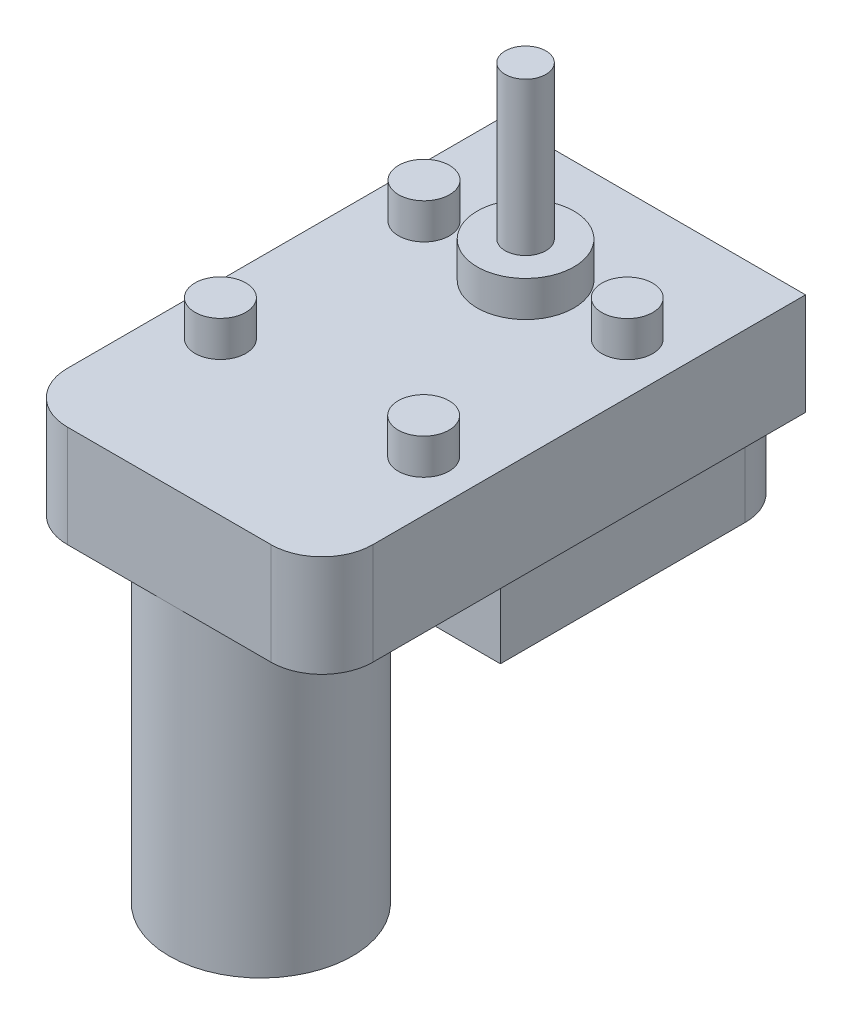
ISO-10303-21;
HEADER;
FILE_DESCRIPTION(('STEP AP214'),'2;1');
FILE_NAME('part.step','',(''),(''),'','','');
FILE_SCHEMA(('AUTOMOTIVE_DESIGN { 1 0 10303 214 1 1 1 1 }'));
ENDSEC;
DATA;
#1=APPLICATION_CONTEXT('core data for automotive mechanical design processes');
#2=APPLICATION_PROTOCOL_DEFINITION('international standard','automotive_design',2000,#1);
#3=PRODUCT_CONTEXT('',#1,'mechanical');
#4=PRODUCT('Part','Part','',(#3));
#5=PRODUCT_RELATED_PRODUCT_CATEGORY('part','',(#4));
#6=PRODUCT_DEFINITION_FORMATION('','',#4);
#7=PRODUCT_DEFINITION_CONTEXT('part definition',#1,'design');
#8=PRODUCT_DEFINITION('design','',#6,#7);
#9=PRODUCT_DEFINITION_SHAPE('','',#8);
#10=(LENGTH_UNIT() NAMED_UNIT(*) SI_UNIT(.MILLI.,.METRE.));
#11=(NAMED_UNIT(*) PLANE_ANGLE_UNIT() SI_UNIT($,.RADIAN.));
#12=(NAMED_UNIT(*) SI_UNIT($,.STERADIAN.) SOLID_ANGLE_UNIT());
#13=UNCERTAINTY_MEASURE_WITH_UNIT(LENGTH_MEASURE(1.E-05),#10,'distance_accuracy_value','');
#14=(GEOMETRIC_REPRESENTATION_CONTEXT(3) GLOBAL_UNCERTAINTY_ASSIGNED_CONTEXT((#13)) GLOBAL_UNIT_ASSIGNED_CONTEXT((#10,
#11,#12)) REPRESENTATION_CONTEXT('',''));
#15=CARTESIAN_POINT('',(0.,0.,0.));
#16=DIRECTION('',(0.,0.,1.));
#17=DIRECTION('',(1.,0.,0.));
#18=AXIS2_PLACEMENT_3D('',#15,#16,#17);
#19=CARTESIAN_POINT('',(0.,0.,0.));
#20=DIRECTION('',(0.,1.,0.));
#21=DIRECTION('',(0.,0.,1.));
#22=AXIS2_PLACEMENT_3D('',#19,#20,#21);
#23=PLANE('',#22);
#24=DIRECTION('',(0.,0.,-1.));
#25=VECTOR('',#24,1.);
#26=CARTESIAN_POINT('',(34.1666666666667,0.,-14.1287878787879));
#27=LINE('',#26,#25);
#28=CARTESIAN_POINT('',(34.1666666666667,0.,70.8712121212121));
#29=VERTEX_POINT('',#28);
#30=CARTESIAN_POINT('',(34.1666666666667,0.,-14.1287878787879));
#31=VERTEX_POINT('',#30);
#32=EDGE_CURVE('E226',#29,#31,#27,.T.);
#33=ORIENTED_EDGE('',*,*,#32,.F.);
#34=CARTESIAN_POINT('',(24.1666666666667,0.,70.8712121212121));
#35=DIRECTION('',(0.,1.,0.));
#36=DIRECTION('',(0.,0.,1.));
#37=AXIS2_PLACEMENT_3D('',#34,#35,#36);
#38=CIRCLE('',#37,10.);
#39=CARTESIAN_POINT('',(24.1666666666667,0.,80.8712121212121));
#40=VERTEX_POINT('',#39);
#41=EDGE_CURVE('E253',#29,#40,#38,.F.);
#42=ORIENTED_EDGE('',*,*,#41,.T.);
#43=DIRECTION('',(1.,0.,0.));
#44=VECTOR('',#43,1.);
#45=CARTESIAN_POINT('',(-25.8333333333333,0.,80.8712121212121));
#46=LINE('',#45,#44);
#47=CARTESIAN_POINT('',(4.16666666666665,0.,80.8712121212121));
#48=VERTEX_POINT('',#47);
#49=EDGE_CURVE('E223',#48,#40,#46,.T.);
#50=ORIENTED_EDGE('',*,*,#49,.F.);
#51=CARTESIAN_POINT('',(4.16666666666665,0.,62.8712121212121));
#52=DIRECTION('',(0.,-1.,0.));
#53=DIRECTION('',(0.,0.,-1.));
#54=AXIS2_PLACEMENT_3D('',#51,#52,#53);
#55=CIRCLE('',#54,18.);
#56=EDGE_CURVE('E148',#48,#48,#55,.T.);
#57=ORIENTED_EDGE('',*,*,#56,.F.);
#58=CARTESIAN_POINT('',(-15.8333333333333,0.,80.8712121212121));
#59=VERTEX_POINT('',#58);
#60=EDGE_CURVE('E224',#59,#48,#46,.T.);
#61=ORIENTED_EDGE('',*,*,#60,.F.);
#62=CARTESIAN_POINT('',(-15.8333333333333,0.,70.8712121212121));
#63=DIRECTION('',(0.,1.,0.));
#64=DIRECTION('',(0.,0.,1.));
#65=AXIS2_PLACEMENT_3D('',#62,#63,#64);
#66=CIRCLE('',#65,10.);
#67=CARTESIAN_POINT('',(-25.8333333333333,0.,70.8712121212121));
#68=VERTEX_POINT('',#67);
#69=EDGE_CURVE('E251',#59,#68,#66,.F.);
#70=ORIENTED_EDGE('',*,*,#69,.T.);
#71=DIRECTION('',(0.,0.,1.));
#72=VECTOR('',#71,1.);
#73=CARTESIAN_POINT('',(-25.8333333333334,0.,-14.1287878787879));
#74=LINE('',#73,#72);
#75=CARTESIAN_POINT('',(-25.8333333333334,0.,-14.1287878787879));
#76=VERTEX_POINT('',#75);
#77=EDGE_CURVE('E209',#76,#68,#74,.T.);
#78=ORIENTED_EDGE('',*,*,#77,.F.);
#79=DIRECTION('',(-1.,0.,0.));
#80=VECTOR('',#79,1.);
#81=CARTESIAN_POINT('',(-25.8333333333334,0.,-14.1287878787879));
#82=LINE('',#81,#80);
#83=EDGE_CURVE('E215',#31,#76,#82,.T.);
#84=ORIENTED_EDGE('',*,*,#83,.F.);
#85=EDGE_LOOP('',(#33,#42,#50,#57,#61,#70,#78,#84));
#86=FACE_BOUND('',#85,.T.);
#87=DIRECTION('',(0.,0.,-1.));
#88=VECTOR('',#87,1.);
#89=CARTESIAN_POINT('',(-23.9045827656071,0.,44.6180599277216));
#90=LINE('',#89,#88);
#91=CARTESIAN_POINT('',(-23.9045827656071,0.,44.6180599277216));
#92=VERTEX_POINT('',#91);
#93=CARTESIAN_POINT('',(-23.9045827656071,0.,-3.43556887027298));
#94=VERTEX_POINT('',#93);
#95=EDGE_CURVE('E158',#92,#94,#90,.T.);
#96=ORIENTED_EDGE('',*,*,#95,.F.);
#97=DIRECTION('',(-1.,0.,0.));
#98=VECTOR('',#97,1.);
#99=CARTESIAN_POINT('',(-23.9045827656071,0.,44.6180599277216));
#100=LINE('',#99,#98);
#101=CARTESIAN_POINT('',(32.9702921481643,0.,44.6180599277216));
#102=VERTEX_POINT('',#101);
#103=EDGE_CURVE('E165',#102,#92,#100,.T.);
#104=ORIENTED_EDGE('',*,*,#103,.F.);
#105=DIRECTION('',(0.,0.,1.));
#106=VECTOR('',#105,1.);
#107=CARTESIAN_POINT('',(32.9702921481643,0.,44.6180599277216));
#108=LINE('',#107,#106);
#109=CARTESIAN_POINT('',(32.9702921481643,0.,-3.43556887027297));
#110=VERTEX_POINT('',#109);
#111=EDGE_CURVE('E144',#110,#102,#108,.T.);
#112=ORIENTED_EDGE('',*,*,#111,.F.);
#113=CARTESIAN_POINT('',(22.9702921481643,0.,-3.43556887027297));
#114=DIRECTION('',(0.,1.,0.));
#115=DIRECTION('',(0.,0.,1.));
#116=AXIS2_PLACEMENT_3D('',#113,#114,#115);
#117=CIRCLE('',#116,10.);
#118=CARTESIAN_POINT('',(22.9702921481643,0.,-13.435568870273));
#119=VERTEX_POINT('',#118);
#120=EDGE_CURVE('E244',#110,#119,#117,.T.);
#121=ORIENTED_EDGE('',*,*,#120,.T.);
#122=DIRECTION('',(1.,0.,0.));
#123=VECTOR('',#122,1.);
#124=CARTESIAN_POINT('',(-23.9045827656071,0.,-13.435568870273));
#125=LINE('',#124,#123);
#126=CARTESIAN_POINT('',(-13.9045827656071,0.,-13.435568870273));
#127=VERTEX_POINT('',#126);
#128=EDGE_CURVE('E161',#127,#119,#125,.T.);
#129=ORIENTED_EDGE('',*,*,#128,.F.);
#130=CARTESIAN_POINT('',(-13.9045827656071,0.,-3.43556887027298));
#131=DIRECTION('',(0.,1.,0.));
#132=DIRECTION('',(0.,0.,1.));
#133=AXIS2_PLACEMENT_3D('',#130,#131,#132);
#134=CIRCLE('',#133,10.);
#135=EDGE_CURVE('E246',#127,#94,#134,.T.);
#136=ORIENTED_EDGE('',*,*,#135,.T.);
#137=EDGE_LOOP('',(#96,#104,#112,#121,#129,#136));
#138=FACE_BOUND('',#137,.T.);
#139=ADVANCED_FACE('F32',(#86,#138),#23,.F.);
#140=CARTESIAN_POINT('',(-25.8333333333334,20.,-14.1287878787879));
#141=DIRECTION('',(1.,0.,0.));
#142=DIRECTION('',(0.,0.,-1.));
#143=AXIS2_PLACEMENT_3D('',#140,#141,#142);
#144=PLANE('',#143);
#145=ORIENTED_EDGE('',*,*,#77,.T.);
#146=DIRECTION('',(0.,-1.,0.));
#147=VECTOR('',#146,1.);
#148=CARTESIAN_POINT('',(-25.8333333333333,20.,70.8712121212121));
#149=LINE('',#148,#147);
#150=CARTESIAN_POINT('',(-25.8333333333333,20.,70.8712121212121));
#151=VERTEX_POINT('',#150);
#152=EDGE_CURVE('E11',#68,#151,#149,.F.);
#153=ORIENTED_EDGE('',*,*,#152,.T.);
#154=DIRECTION('',(0.,0.,1.));
#155=VECTOR('',#154,1.);
#156=CARTESIAN_POINT('',(-25.8333333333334,20.,-14.1287878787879));
#157=LINE('',#156,#155);
#158=CARTESIAN_POINT('',(-25.8333333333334,20.,-14.1287878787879));
#159=VERTEX_POINT('',#158);
#160=EDGE_CURVE('E212',#159,#151,#157,.T.);
#161=ORIENTED_EDGE('',*,*,#160,.F.);
#162=DIRECTION('',(0.,-1.,0.));
#163=VECTOR('',#162,1.);
#164=CARTESIAN_POINT('',(-25.8333333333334,20.,-14.1287878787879));
#165=LINE('',#164,#163);
#166=EDGE_CURVE('E221',#159,#76,#165,.T.);
#167=ORIENTED_EDGE('',*,*,#166,.T.);
#168=EDGE_LOOP('',(#145,#153,#161,#167));
#169=FACE_BOUND('',#168,.T.);
#170=ADVANCED_FACE('F300',(#169),#144,.F.);
#171=CARTESIAN_POINT('',(-25.8333333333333,20.,80.8712121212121));
#172=DIRECTION('',(0.,0.,-1.));
#173=DIRECTION('',(-1.,0.,0.));
#174=AXIS2_PLACEMENT_3D('',#171,#172,#173);
#175=PLANE('',#174);
#176=ORIENTED_EDGE('',*,*,#49,.T.);
#177=DIRECTION('',(0.,-1.,0.));
#178=VECTOR('',#177,1.);
#179=CARTESIAN_POINT('',(24.1666666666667,20.,80.8712121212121));
#180=LINE('',#179,#178);
#181=CARTESIAN_POINT('',(24.1666666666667,20.,80.8712121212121));
#182=VERTEX_POINT('',#181);
#183=EDGE_CURVE('E53',#40,#182,#180,.F.);
#184=ORIENTED_EDGE('',*,*,#183,.T.);
#185=DIRECTION('',(1.,0.,0.));
#186=VECTOR('',#185,1.);
#187=CARTESIAN_POINT('',(-25.8333333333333,20.,80.8712121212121));
#188=LINE('',#187,#186);
#189=CARTESIAN_POINT('',(-15.8333333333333,20.,80.8712121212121));
#190=VERTEX_POINT('',#189);
#191=EDGE_CURVE('E214',#190,#182,#188,.T.);
#192=ORIENTED_EDGE('',*,*,#191,.F.);
#193=DIRECTION('',(0.,-1.,0.));
#194=VECTOR('',#193,1.);
#195=CARTESIAN_POINT('',(-15.8333333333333,20.,80.8712121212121));
#196=LINE('',#195,#194);
#197=EDGE_CURVE('E255',#190,#59,#196,.T.);
#198=ORIENTED_EDGE('',*,*,#197,.T.);
#199=ORIENTED_EDGE('',*,*,#60,.T.);
#200=EDGE_LOOP('',(#176,#184,#192,#198,#199));
#201=FACE_BOUND('',#200,.T.);
#202=ADVANCED_FACE('F277',(#201),#175,.F.);
#203=CARTESIAN_POINT('',(34.1666666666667,20.,-14.1287878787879));
#204=DIRECTION('',(-1.,0.,0.));
#205=DIRECTION('',(0.,0.,1.));
#206=AXIS2_PLACEMENT_3D('',#203,#204,#205);
#207=PLANE('',#206);
#208=DIRECTION('',(0.,0.,-1.));
#209=VECTOR('',#208,1.);
#210=CARTESIAN_POINT('',(34.1666666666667,20.,-14.1287878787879));
#211=LINE('',#210,#209);
#212=CARTESIAN_POINT('',(34.1666666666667,20.,70.8712121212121));
#213=VERTEX_POINT('',#212);
#214=CARTESIAN_POINT('',(34.1666666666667,20.,-14.1287878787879));
#215=VERTEX_POINT('',#214);
#216=EDGE_CURVE('E217',#213,#215,#211,.T.);
#217=ORIENTED_EDGE('',*,*,#216,.F.);
#218=DIRECTION('',(0.,-1.,0.));
#219=VECTOR('',#218,1.);
#220=CARTESIAN_POINT('',(34.1666666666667,20.,70.8712121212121));
#221=LINE('',#220,#219);
#222=EDGE_CURVE('E248',#213,#29,#221,.T.);
#223=ORIENTED_EDGE('',*,*,#222,.T.);
#224=ORIENTED_EDGE('',*,*,#32,.T.);
#225=DIRECTION('',(0.,-1.,0.));
#226=VECTOR('',#225,1.);
#227=CARTESIAN_POINT('',(34.1666666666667,20.,-14.1287878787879));
#228=LINE('',#227,#226);
#229=EDGE_CURVE('E181',#215,#31,#228,.T.);
#230=ORIENTED_EDGE('',*,*,#229,.F.);
#231=EDGE_LOOP('',(#217,#223,#224,#230));
#232=FACE_BOUND('',#231,.T.);
#233=ADVANCED_FACE('F268',(#232),#207,.F.);
#234=CARTESIAN_POINT('',(-25.8333333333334,20.,-14.1287878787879));
#235=DIRECTION('',(0.,0.,1.));
#236=DIRECTION('',(1.,0.,0.));
#237=AXIS2_PLACEMENT_3D('',#234,#235,#236);
#238=PLANE('',#237);
#239=ORIENTED_EDGE('',*,*,#83,.T.);
#240=ORIENTED_EDGE('',*,*,#166,.F.);
#241=DIRECTION('',(-1.,0.,0.));
#242=VECTOR('',#241,1.);
#243=CARTESIAN_POINT('',(-25.8333333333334,20.,-14.1287878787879));
#244=LINE('',#243,#242);
#245=EDGE_CURVE('E219',#215,#159,#244,.T.);
#246=ORIENTED_EDGE('',*,*,#245,.F.);
#247=ORIENTED_EDGE('',*,*,#229,.T.);
#248=EDGE_LOOP('',(#239,#240,#246,#247));
#249=FACE_BOUND('',#248,.T.);
#250=ADVANCED_FACE('F309',(#249),#238,.F.);
#251=CARTESIAN_POINT('',(0.,20.,0.));
#252=DIRECTION('',(0.,1.,0.));
#253=DIRECTION('',(0.,0.,1.));
#254=AXIS2_PLACEMENT_3D('',#251,#252,#253);
#255=PLANE('',#254);
#256=CARTESIAN_POINT('',(24.1666666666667,20.,50.8941681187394));
#257=DIRECTION('',(0.,1.,0.));
#258=DIRECTION('',(0.,0.,1.));
#259=AXIS2_PLACEMENT_3D('',#256,#257,#258);
#260=CIRCLE('',#259,5.);
#261=CARTESIAN_POINT('',(24.1666666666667,20.,45.8941681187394));
#262=VERTEX_POINT('',#261);
#263=EDGE_CURVE('E176',#262,#262,#260,.T.);
#264=ORIENTED_EDGE('',*,*,#263,.F.);
#265=EDGE_LOOP('',(#264));
#266=FACE_BOUND('',#265,.T.);
#267=CARTESIAN_POINT('',(-15.8333333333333,20.,50.8144507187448));
#268=DIRECTION('',(0.,1.,0.));
#269=DIRECTION('',(0.,0.,1.));
#270=AXIS2_PLACEMENT_3D('',#267,#268,#269);
#271=CIRCLE('',#270,5.);
#272=CARTESIAN_POINT('',(-15.8333333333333,20.,45.8144507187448));
#273=VERTEX_POINT('',#272);
#274=EDGE_CURVE('E185',#273,#273,#271,.T.);
#275=ORIENTED_EDGE('',*,*,#274,.F.);
#276=EDGE_LOOP('',(#275));
#277=FACE_BOUND('',#276,.T.);
#278=CARTESIAN_POINT('',(-15.8333333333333,20.,10.8144507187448));
#279=DIRECTION('',(0.,1.,0.));
#280=DIRECTION('',(0.,0.,1.));
#281=AXIS2_PLACEMENT_3D('',#278,#279,#280);
#282=CIRCLE('',#281,5.);
#283=CARTESIAN_POINT('',(-15.8333333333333,20.,5.81445071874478));
#284=VERTEX_POINT('',#283);
#285=EDGE_CURVE('E191',#284,#284,#282,.T.);
#286=ORIENTED_EDGE('',*,*,#285,.F.);
#287=EDGE_LOOP('',(#286));
#288=FACE_BOUND('',#287,.T.);
#289=CARTESIAN_POINT('',(24.1666666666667,20.,10.8941681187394));
#290=DIRECTION('',(0.,1.,0.));
#291=DIRECTION('',(0.,0.,1.));
#292=AXIS2_PLACEMENT_3D('',#289,#290,#291);
#293=CIRCLE('',#292,5.);
#294=CARTESIAN_POINT('',(24.1666666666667,20.,5.89416811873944));
#295=VERTEX_POINT('',#294);
#296=EDGE_CURVE('E197',#295,#295,#293,.T.);
#297=ORIENTED_EDGE('',*,*,#296,.F.);
#298=EDGE_LOOP('',(#297));
#299=FACE_BOUND('',#298,.T.);
#300=CARTESIAN_POINT('',(4.16666666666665,20.,10.8712121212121));
#301=DIRECTION('',(0.,1.,0.));
#302=DIRECTION('',(0.,0.,1.));
#303=AXIS2_PLACEMENT_3D('',#300,#301,#302);
#304=CIRCLE('',#303,9.5);
#305=CARTESIAN_POINT('',(4.16666666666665,20.,1.37121212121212));
#306=VERTEX_POINT('',#305);
#307=EDGE_CURVE('E203',#306,#306,#304,.T.);
#308=ORIENTED_EDGE('',*,*,#307,.F.);
#309=EDGE_LOOP('',(#308));
#310=FACE_BOUND('',#309,.T.);
#311=ORIENTED_EDGE('',*,*,#191,.T.);
#312=CARTESIAN_POINT('',(24.1666666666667,20.,70.8712121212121));
#313=DIRECTION('',(0.,1.,0.));
#314=DIRECTION('',(0.,0.,1.));
#315=AXIS2_PLACEMENT_3D('',#312,#313,#314);
#316=CIRCLE('',#315,10.);
#317=EDGE_CURVE('E40',#182,#213,#316,.T.);
#318=ORIENTED_EDGE('',*,*,#317,.T.);
#319=ORIENTED_EDGE('',*,*,#216,.T.);
#320=ORIENTED_EDGE('',*,*,#245,.T.);
#321=ORIENTED_EDGE('',*,*,#160,.T.);
#322=CARTESIAN_POINT('',(-15.8333333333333,20.,70.8712121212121));
#323=DIRECTION('',(0.,1.,0.));
#324=DIRECTION('',(0.,0.,1.));
#325=AXIS2_PLACEMENT_3D('',#322,#323,#324);
#326=CIRCLE('',#325,10.);
#327=EDGE_CURVE('E259',#151,#190,#326,.T.);
#328=ORIENTED_EDGE('',*,*,#327,.T.);
#329=EDGE_LOOP('',(#311,#318,#319,#320,#321,#328));
#330=FACE_BOUND('',#329,.T.);
#331=ADVANCED_FACE('F263',(#266,#277,#288,#299,#310,#330),#255,.T.);
#332=CARTESIAN_POINT('',(4.16666666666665,27.,10.8712121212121));
#333=DIRECTION('',(0.,-1.,0.));
#334=DIRECTION('',(0.,0.,-1.));
#335=AXIS2_PLACEMENT_3D('',#332,#333,#334);
#336=CYLINDRICAL_SURFACE('',#335,9.5);
#337=CARTESIAN_POINT('',(4.16666666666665,27.,10.8712121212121));
#338=DIRECTION('',(0.,1.,0.));
#339=DIRECTION('',(0.,0.,1.));
#340=AXIS2_PLACEMENT_3D('',#337,#338,#339);
#341=CIRCLE('',#340,9.5);
#342=CARTESIAN_POINT('',(4.16666666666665,27.,1.37121212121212));
#343=VERTEX_POINT('',#342);
#344=EDGE_CURVE('E206',#343,#343,#341,.T.);
#345=CARTESIAN_POINT('',(4.16666666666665,27.,1.37121212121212));
#346=CARTESIAN_POINT('',(4.16666666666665,26.9270833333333,1.37121212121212));
#347=CARTESIAN_POINT('',(4.16666666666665,26.8541666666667,1.37121212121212));
#348=CARTESIAN_POINT('',(4.16666666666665,26.7083333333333,1.37121212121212));
#349=CARTESIAN_POINT('',(4.16666666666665,26.6354166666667,1.37121212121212));
#350=CARTESIAN_POINT('',(4.16666666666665,26.4895833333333,1.37121212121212));
#351=CARTESIAN_POINT('',(4.16666666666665,26.4166666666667,1.37121212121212));
#352=CARTESIAN_POINT('',(4.16666666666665,26.2708333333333,1.37121212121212));
#353=CARTESIAN_POINT('',(4.16666666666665,26.1979166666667,1.37121212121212));
#354=CARTESIAN_POINT('',(4.16666666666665,26.0520833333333,1.37121212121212));
#355=CARTESIAN_POINT('',(4.16666666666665,25.9791666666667,1.37121212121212));
#356=CARTESIAN_POINT('',(4.16666666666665,25.8333333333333,1.37121212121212));
#357=CARTESIAN_POINT('',(4.16666666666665,25.7604166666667,1.37121212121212));
#358=CARTESIAN_POINT('',(4.16666666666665,25.6145833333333,1.37121212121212));
#359=CARTESIAN_POINT('',(4.16666666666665,25.5416666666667,1.37121212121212));
#360=CARTESIAN_POINT('',(4.16666666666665,25.3958333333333,1.37121212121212));
#361=CARTESIAN_POINT('',(4.16666666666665,25.3229166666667,1.37121212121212));
#362=CARTESIAN_POINT('',(4.16666666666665,25.1770833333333,1.37121212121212));
#363=CARTESIAN_POINT('',(4.16666666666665,25.1041666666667,1.37121212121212));
#364=CARTESIAN_POINT('',(4.16666666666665,24.9583333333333,1.37121212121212));
#365=CARTESIAN_POINT('',(4.16666666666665,24.8854166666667,1.37121212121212));
#366=CARTESIAN_POINT('',(4.16666666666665,24.7395833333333,1.37121212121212));
#367=CARTESIAN_POINT('',(4.16666666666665,24.6666666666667,1.37121212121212));
#368=CARTESIAN_POINT('',(4.16666666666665,24.5208333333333,1.37121212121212));
#369=CARTESIAN_POINT('',(4.16666666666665,24.4479166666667,1.37121212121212));
#370=CARTESIAN_POINT('',(4.16666666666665,24.3020833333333,1.37121212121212));
#371=CARTESIAN_POINT('',(4.16666666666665,24.2291666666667,1.37121212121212));
#372=CARTESIAN_POINT('',(4.16666666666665,24.0833333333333,1.37121212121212));
#373=CARTESIAN_POINT('',(4.16666666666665,24.0104166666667,1.37121212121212));
#374=CARTESIAN_POINT('',(4.16666666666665,23.8645833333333,1.37121212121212));
#375=CARTESIAN_POINT('',(4.16666666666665,23.7916666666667,1.37121212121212));
#376=CARTESIAN_POINT('',(4.16666666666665,23.6458333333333,1.37121212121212));
#377=CARTESIAN_POINT('',(4.16666666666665,23.5729166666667,1.37121212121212));
#378=CARTESIAN_POINT('',(4.16666666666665,23.4270833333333,1.37121212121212));
#379=CARTESIAN_POINT('',(4.16666666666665,23.3541666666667,1.37121212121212));
#380=CARTESIAN_POINT('',(4.16666666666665,23.2083333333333,1.37121212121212));
#381=CARTESIAN_POINT('',(4.16666666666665,23.1354166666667,1.37121212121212));
#382=CARTESIAN_POINT('',(4.16666666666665,22.9895833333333,1.37121212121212));
#383=CARTESIAN_POINT('',(4.16666666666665,22.9166666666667,1.37121212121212));
#384=CARTESIAN_POINT('',(4.16666666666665,22.7708333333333,1.37121212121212));
#385=CARTESIAN_POINT('',(4.16666666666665,22.6979166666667,1.37121212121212));
#386=CARTESIAN_POINT('',(4.16666666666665,22.5520833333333,1.37121212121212));
#387=CARTESIAN_POINT('',(4.16666666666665,22.4791666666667,1.37121212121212));
#388=CARTESIAN_POINT('',(4.16666666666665,22.3333333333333,1.37121212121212));
#389=CARTESIAN_POINT('',(4.16666666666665,22.2604166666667,1.37121212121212));
#390=CARTESIAN_POINT('',(4.16666666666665,22.1145833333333,1.37121212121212));
#391=CARTESIAN_POINT('',(4.16666666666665,22.0416666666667,1.37121212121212));
#392=CARTESIAN_POINT('',(4.16666666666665,21.8958333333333,1.37121212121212));
#393=CARTESIAN_POINT('',(4.16666666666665,21.8229166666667,1.37121212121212));
#394=CARTESIAN_POINT('',(4.16666666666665,21.6770833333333,1.37121212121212));
#395=CARTESIAN_POINT('',(4.16666666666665,21.6041666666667,1.37121212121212));
#396=CARTESIAN_POINT('',(4.16666666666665,21.4583333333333,1.37121212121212));
#397=CARTESIAN_POINT('',(4.16666666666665,21.3854166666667,1.37121212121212));
#398=CARTESIAN_POINT('',(4.16666666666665,21.2395833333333,1.37121212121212));
#399=CARTESIAN_POINT('',(4.16666666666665,21.1666666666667,1.37121212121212));
#400=CARTESIAN_POINT('',(4.16666666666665,21.0208333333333,1.37121212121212));
#401=CARTESIAN_POINT('',(4.16666666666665,20.9479166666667,1.37121212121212));
#402=CARTESIAN_POINT('',(4.16666666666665,20.8020833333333,1.37121212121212));
#403=CARTESIAN_POINT('',(4.16666666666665,20.7291666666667,1.37121212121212));
#404=CARTESIAN_POINT('',(4.16666666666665,20.5833333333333,1.37121212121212));
#405=CARTESIAN_POINT('',(4.16666666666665,20.5104166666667,1.37121212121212));
#406=CARTESIAN_POINT('',(4.16666666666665,20.3645833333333,1.37121212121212));
#407=CARTESIAN_POINT('',(4.16666666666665,20.2916666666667,1.37121212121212));
#408=CARTESIAN_POINT('',(4.16666666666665,20.1458333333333,1.37121212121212));
#409=CARTESIAN_POINT('',(4.16666666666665,20.0729166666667,1.37121212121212));
#410=CARTESIAN_POINT('',(4.16666666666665,20.,1.37121212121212));
#411=B_SPLINE_CURVE_WITH_KNOTS('',3,(#345,#346,#347,#348,#349,#350,#351,#352,#353,#354,#355,
#356,#357,#358,#359,#360,#361,#362,#363,#364,#365,#366,#367,#368,#369,#370,#371,#372,#373,#374,
#375,#376,#377,#378,#379,#380,#381,#382,#383,#384,#385,#386,#387,#388,#389,#390,#391,#392,#393,
#394,#395,#396,#397,#398,#399,#400,#401,#402,#403,#404,#405,#406,#407,#408,#409,#410),
.UNSPECIFIED.,.F.,.F.,(4,2,2,2,2,2,2,2,2,2,2,2,2,2,2,2,2,2,2,2,2,2,2,2,2,2,2,2,2,2,2,2,4),(0.,
0.21875,0.4375,0.656250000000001,0.875000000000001,1.09375,1.3125,1.53125,1.75,1.96875,2.1875,
2.40625,2.625,2.84375,3.0625,3.28125,3.5,3.71875,3.9375,4.15625,4.375,4.59375,4.8125,5.03125,
5.25,5.46875,5.6875,5.90625,6.125,6.34375,6.5625,6.78125,7.),.UNSPECIFIED.);
#412=EDGE_CURVE('BSEAM347',#343,#306,#411,.T.);
#413=ORIENTED_EDGE('',*,*,#344,.F.);
#414=ORIENTED_EDGE('',*,*,#307,.T.);
#415=ORIENTED_EDGE('',*,*,#412,.T.);
#416=ORIENTED_EDGE('',*,*,#412,.F.);
#417=EDGE_LOOP('',(#413,#415,#414,#416));
#418=FACE_BOUND('',#417,.T.);
#419=ADVANCED_FACE('F347',(#418),#336,.T.);
#420=CARTESIAN_POINT('',(4.16666666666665,27.,10.8712121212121));
#421=DIRECTION('',(0.,1.,0.));
#422=DIRECTION('',(0.,0.,1.));
#423=AXIS2_PLACEMENT_3D('',#420,#421,#422);
#424=PLANE('',#423);
#425=CARTESIAN_POINT('',(4.16666666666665,27.,10.8712121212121));
#426=DIRECTION('',(0.,1.,0.));
#427=DIRECTION('',(0.,0.,1.));
#428=AXIS2_PLACEMENT_3D('',#425,#426,#427);
#429=CIRCLE('',#428,4.);
#430=CARTESIAN_POINT('',(4.16666666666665,27.,14.8712121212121));
#431=VERTEX_POINT('',#430);
#432=EDGE_CURVE('E177',#431,#431,#429,.T.);
#433=ORIENTED_EDGE('',*,*,#432,.F.);
#434=EDGE_LOOP('',(#433));
#435=FACE_BOUND('',#434,.T.);
#436=ORIENTED_EDGE('',*,*,#344,.T.);
#437=EDGE_LOOP('',(#436));
#438=FACE_BOUND('',#437,.T.);
#439=ADVANCED_FACE('F459',(#435,#438),#424,.T.);
#440=CARTESIAN_POINT('',(24.1666666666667,27.,10.8941681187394));
#441=DIRECTION('',(0.,-1.,0.));
#442=DIRECTION('',(0.,0.,-1.));
#443=AXIS2_PLACEMENT_3D('',#440,#441,#442);
#444=CYLINDRICAL_SURFACE('',#443,5.);
#445=CARTESIAN_POINT('',(24.1666666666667,27.,10.8941681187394));
#446=DIRECTION('',(0.,1.,0.));
#447=DIRECTION('',(0.,0.,1.));
#448=AXIS2_PLACEMENT_3D('',#445,#446,#447);
#449=CIRCLE('',#448,5.);
#450=CARTESIAN_POINT('',(24.1666666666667,27.,5.89416811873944));
#451=VERTEX_POINT('',#450);
#452=EDGE_CURVE('E200',#451,#451,#449,.T.);
#453=CARTESIAN_POINT('',(24.1666666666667,27.,5.89416811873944));
#454=CARTESIAN_POINT('',(24.1666666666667,26.9270833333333,5.89416811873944));
#455=CARTESIAN_POINT('',(24.1666666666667,26.8541666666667,5.89416811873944));
#456=CARTESIAN_POINT('',(24.1666666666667,26.7083333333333,5.89416811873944));
#457=CARTESIAN_POINT('',(24.1666666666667,26.6354166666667,5.89416811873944));
#458=CARTESIAN_POINT('',(24.1666666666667,26.4895833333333,5.89416811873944));
#459=CARTESIAN_POINT('',(24.1666666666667,26.4166666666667,5.89416811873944));
#460=CARTESIAN_POINT('',(24.1666666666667,26.2708333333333,5.89416811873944));
#461=CARTESIAN_POINT('',(24.1666666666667,26.1979166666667,5.89416811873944));
#462=CARTESIAN_POINT('',(24.1666666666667,26.0520833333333,5.89416811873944));
#463=CARTESIAN_POINT('',(24.1666666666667,25.9791666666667,5.89416811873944));
#464=CARTESIAN_POINT('',(24.1666666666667,25.8333333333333,5.89416811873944));
#465=CARTESIAN_POINT('',(24.1666666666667,25.7604166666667,5.89416811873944));
#466=CARTESIAN_POINT('',(24.1666666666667,25.6145833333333,5.89416811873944));
#467=CARTESIAN_POINT('',(24.1666666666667,25.5416666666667,5.89416811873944));
#468=CARTESIAN_POINT('',(24.1666666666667,25.3958333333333,5.89416811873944));
#469=CARTESIAN_POINT('',(24.1666666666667,25.3229166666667,5.89416811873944));
#470=CARTESIAN_POINT('',(24.1666666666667,25.1770833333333,5.89416811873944));
#471=CARTESIAN_POINT('',(24.1666666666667,25.1041666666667,5.89416811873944));
#472=CARTESIAN_POINT('',(24.1666666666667,24.9583333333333,5.89416811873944));
#473=CARTESIAN_POINT('',(24.1666666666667,24.8854166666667,5.89416811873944));
#474=CARTESIAN_POINT('',(24.1666666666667,24.7395833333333,5.89416811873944));
#475=CARTESIAN_POINT('',(24.1666666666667,24.6666666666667,5.89416811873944));
#476=CARTESIAN_POINT('',(24.1666666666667,24.5208333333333,5.89416811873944));
#477=CARTESIAN_POINT('',(24.1666666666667,24.4479166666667,5.89416811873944));
#478=CARTESIAN_POINT('',(24.1666666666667,24.3020833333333,5.89416811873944));
#479=CARTESIAN_POINT('',(24.1666666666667,24.2291666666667,5.89416811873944));
#480=CARTESIAN_POINT('',(24.1666666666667,24.0833333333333,5.89416811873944));
#481=CARTESIAN_POINT('',(24.1666666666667,24.0104166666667,5.89416811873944));
#482=CARTESIAN_POINT('',(24.1666666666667,23.8645833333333,5.89416811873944));
#483=CARTESIAN_POINT('',(24.1666666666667,23.7916666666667,5.89416811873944));
#484=CARTESIAN_POINT('',(24.1666666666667,23.6458333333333,5.89416811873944));
#485=CARTESIAN_POINT('',(24.1666666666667,23.5729166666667,5.89416811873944));
#486=CARTESIAN_POINT('',(24.1666666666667,23.4270833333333,5.89416811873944));
#487=CARTESIAN_POINT('',(24.1666666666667,23.3541666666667,5.89416811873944));
#488=CARTESIAN_POINT('',(24.1666666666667,23.2083333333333,5.89416811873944));
#489=CARTESIAN_POINT('',(24.1666666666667,23.1354166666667,5.89416811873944));
#490=CARTESIAN_POINT('',(24.1666666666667,22.9895833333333,5.89416811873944));
#491=CARTESIAN_POINT('',(24.1666666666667,22.9166666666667,5.89416811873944));
#492=CARTESIAN_POINT('',(24.1666666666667,22.7708333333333,5.89416811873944));
#493=CARTESIAN_POINT('',(24.1666666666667,22.6979166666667,5.89416811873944));
#494=CARTESIAN_POINT('',(24.1666666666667,22.5520833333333,5.89416811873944));
#495=CARTESIAN_POINT('',(24.1666666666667,22.4791666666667,5.89416811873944));
#496=CARTESIAN_POINT('',(24.1666666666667,22.3333333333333,5.89416811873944));
#497=CARTESIAN_POINT('',(24.1666666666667,22.2604166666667,5.89416811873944));
#498=CARTESIAN_POINT('',(24.1666666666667,22.1145833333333,5.89416811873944));
#499=CARTESIAN_POINT('',(24.1666666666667,22.0416666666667,5.89416811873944));
#500=CARTESIAN_POINT('',(24.1666666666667,21.8958333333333,5.89416811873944));
#501=CARTESIAN_POINT('',(24.1666666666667,21.8229166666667,5.89416811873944));
#502=CARTESIAN_POINT('',(24.1666666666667,21.6770833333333,5.89416811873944));
#503=CARTESIAN_POINT('',(24.1666666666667,21.6041666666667,5.89416811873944));
#504=CARTESIAN_POINT('',(24.1666666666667,21.4583333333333,5.89416811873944));
#505=CARTESIAN_POINT('',(24.1666666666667,21.3854166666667,5.89416811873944));
#506=CARTESIAN_POINT('',(24.1666666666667,21.2395833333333,5.89416811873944));
#507=CARTESIAN_POINT('',(24.1666666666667,21.1666666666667,5.89416811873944));
#508=CARTESIAN_POINT('',(24.1666666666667,21.0208333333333,5.89416811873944));
#509=CARTESIAN_POINT('',(24.1666666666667,20.9479166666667,5.89416811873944));
#510=CARTESIAN_POINT('',(24.1666666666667,20.8020833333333,5.89416811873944));
#511=CARTESIAN_POINT('',(24.1666666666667,20.7291666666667,5.89416811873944));
#512=CARTESIAN_POINT('',(24.1666666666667,20.5833333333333,5.89416811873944));
#513=CARTESIAN_POINT('',(24.1666666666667,20.5104166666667,5.89416811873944));
#514=CARTESIAN_POINT('',(24.1666666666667,20.3645833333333,5.89416811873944));
#515=CARTESIAN_POINT('',(24.1666666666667,20.2916666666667,5.89416811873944));
#516=CARTESIAN_POINT('',(24.1666666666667,20.1458333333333,5.89416811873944));
#517=CARTESIAN_POINT('',(24.1666666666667,20.0729166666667,5.89416811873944));
#518=CARTESIAN_POINT('',(24.1666666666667,20.,5.89416811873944));
#519=B_SPLINE_CURVE_WITH_KNOTS('',3,(#453,#454,#455,#456,#457,#458,#459,#460,#461,#462,#463,
#464,#465,#466,#467,#468,#469,#470,#471,#472,#473,#474,#475,#476,#477,#478,#479,#480,#481,#482,
#483,#484,#485,#486,#487,#488,#489,#490,#491,#492,#493,#494,#495,#496,#497,#498,#499,#500,#501,
#502,#503,#504,#505,#506,#507,#508,#509,#510,#511,#512,#513,#514,#515,#516,#517,#518),
.UNSPECIFIED.,.F.,.F.,(4,2,2,2,2,2,2,2,2,2,2,2,2,2,2,2,2,2,2,2,2,2,2,2,2,2,2,2,2,2,2,2,4),(0.,
0.21875,0.4375,0.656250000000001,0.875000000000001,1.09375,1.3125,1.53125,1.75,1.96875,2.1875,
2.40625,2.625,2.84375,3.0625,3.28125,3.5,3.71875,3.9375,4.15625,4.375,4.59375,4.8125,5.03125,
5.25,5.46875,5.6875,5.90625,6.125,6.34375,6.5625,6.78125,7.),.UNSPECIFIED.);
#520=EDGE_CURVE('BSEAM464',#451,#295,#519,.T.);
#521=ORIENTED_EDGE('',*,*,#452,.F.);
#522=ORIENTED_EDGE('',*,*,#296,.T.);
#523=ORIENTED_EDGE('',*,*,#520,.T.);
#524=ORIENTED_EDGE('',*,*,#520,.F.);
#525=EDGE_LOOP('',(#521,#523,#522,#524));
#526=FACE_BOUND('',#525,.T.);
#527=ADVANCED_FACE('F464',(#526),#444,.T.);
#528=CARTESIAN_POINT('',(24.1666666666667,27.,10.8941681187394));
#529=DIRECTION('',(0.,1.,0.));
#530=DIRECTION('',(0.,0.,1.));
#531=AXIS2_PLACEMENT_3D('',#528,#529,#530);
#532=PLANE('',#531);
#533=ORIENTED_EDGE('',*,*,#452,.T.);
#534=EDGE_LOOP('',(#533));
#535=FACE_BOUND('',#534,.T.);
#536=ADVANCED_FACE('F524',(#535),#532,.T.);
#537=CARTESIAN_POINT('',(-15.8333333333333,27.,10.8144507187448));
#538=DIRECTION('',(0.,-1.,0.));
#539=DIRECTION('',(0.,0.,-1.));
#540=AXIS2_PLACEMENT_3D('',#537,#538,#539);
#541=CYLINDRICAL_SURFACE('',#540,5.);
#542=CARTESIAN_POINT('',(-15.8333333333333,27.,10.8144507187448));
#543=DIRECTION('',(0.,1.,0.));
#544=DIRECTION('',(0.,0.,1.));
#545=AXIS2_PLACEMENT_3D('',#542,#543,#544);
#546=CIRCLE('',#545,5.);
#547=CARTESIAN_POINT('',(-15.8333333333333,27.,5.81445071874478));
#548=VERTEX_POINT('',#547);
#549=EDGE_CURVE('E194',#548,#548,#546,.T.);
#550=CARTESIAN_POINT('',(-15.8333333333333,27.,5.81445071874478));
#551=CARTESIAN_POINT('',(-15.8333333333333,26.9270833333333,5.81445071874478));
#552=CARTESIAN_POINT('',(-15.8333333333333,26.8541666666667,5.81445071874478));
#553=CARTESIAN_POINT('',(-15.8333333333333,26.7083333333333,5.81445071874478));
#554=CARTESIAN_POINT('',(-15.8333333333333,26.6354166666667,5.81445071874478));
#555=CARTESIAN_POINT('',(-15.8333333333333,26.4895833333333,5.81445071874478));
#556=CARTESIAN_POINT('',(-15.8333333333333,26.4166666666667,5.81445071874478));
#557=CARTESIAN_POINT('',(-15.8333333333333,26.2708333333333,5.81445071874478));
#558=CARTESIAN_POINT('',(-15.8333333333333,26.1979166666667,5.81445071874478));
#559=CARTESIAN_POINT('',(-15.8333333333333,26.0520833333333,5.81445071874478));
#560=CARTESIAN_POINT('',(-15.8333333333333,25.9791666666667,5.81445071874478));
#561=CARTESIAN_POINT('',(-15.8333333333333,25.8333333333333,5.81445071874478));
#562=CARTESIAN_POINT('',(-15.8333333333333,25.7604166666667,5.81445071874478));
#563=CARTESIAN_POINT('',(-15.8333333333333,25.6145833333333,5.81445071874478));
#564=CARTESIAN_POINT('',(-15.8333333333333,25.5416666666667,5.81445071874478));
#565=CARTESIAN_POINT('',(-15.8333333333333,25.3958333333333,5.81445071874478));
#566=CARTESIAN_POINT('',(-15.8333333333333,25.3229166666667,5.81445071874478));
#567=CARTESIAN_POINT('',(-15.8333333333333,25.1770833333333,5.81445071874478));
#568=CARTESIAN_POINT('',(-15.8333333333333,25.1041666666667,5.81445071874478));
#569=CARTESIAN_POINT('',(-15.8333333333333,24.9583333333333,5.81445071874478));
#570=CARTESIAN_POINT('',(-15.8333333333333,24.8854166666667,5.81445071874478));
#571=CARTESIAN_POINT('',(-15.8333333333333,24.7395833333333,5.81445071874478));
#572=CARTESIAN_POINT('',(-15.8333333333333,24.6666666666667,5.81445071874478));
#573=CARTESIAN_POINT('',(-15.8333333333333,24.5208333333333,5.81445071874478));
#574=CARTESIAN_POINT('',(-15.8333333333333,24.4479166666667,5.81445071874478));
#575=CARTESIAN_POINT('',(-15.8333333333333,24.3020833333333,5.81445071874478));
#576=CARTESIAN_POINT('',(-15.8333333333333,24.2291666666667,5.81445071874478));
#577=CARTESIAN_POINT('',(-15.8333333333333,24.0833333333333,5.81445071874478));
#578=CARTESIAN_POINT('',(-15.8333333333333,24.0104166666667,5.81445071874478));
#579=CARTESIAN_POINT('',(-15.8333333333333,23.8645833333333,5.81445071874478));
#580=CARTESIAN_POINT('',(-15.8333333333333,23.7916666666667,5.81445071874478));
#581=CARTESIAN_POINT('',(-15.8333333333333,23.6458333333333,5.81445071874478));
#582=CARTESIAN_POINT('',(-15.8333333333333,23.5729166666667,5.81445071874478));
#583=CARTESIAN_POINT('',(-15.8333333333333,23.4270833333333,5.81445071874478));
#584=CARTESIAN_POINT('',(-15.8333333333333,23.3541666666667,5.81445071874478));
#585=CARTESIAN_POINT('',(-15.8333333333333,23.2083333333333,5.81445071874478));
#586=CARTESIAN_POINT('',(-15.8333333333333,23.1354166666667,5.81445071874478));
#587=CARTESIAN_POINT('',(-15.8333333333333,22.9895833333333,5.81445071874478));
#588=CARTESIAN_POINT('',(-15.8333333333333,22.9166666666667,5.81445071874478));
#589=CARTESIAN_POINT('',(-15.8333333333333,22.7708333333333,5.81445071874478));
#590=CARTESIAN_POINT('',(-15.8333333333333,22.6979166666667,5.81445071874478));
#591=CARTESIAN_POINT('',(-15.8333333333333,22.5520833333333,5.81445071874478));
#592=CARTESIAN_POINT('',(-15.8333333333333,22.4791666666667,5.81445071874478));
#593=CARTESIAN_POINT('',(-15.8333333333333,22.3333333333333,5.81445071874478));
#594=CARTESIAN_POINT('',(-15.8333333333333,22.2604166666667,5.81445071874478));
#595=CARTESIAN_POINT('',(-15.8333333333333,22.1145833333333,5.81445071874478));
#596=CARTESIAN_POINT('',(-15.8333333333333,22.0416666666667,5.81445071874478));
#597=CARTESIAN_POINT('',(-15.8333333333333,21.8958333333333,5.81445071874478));
#598=CARTESIAN_POINT('',(-15.8333333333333,21.8229166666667,5.81445071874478));
#599=CARTESIAN_POINT('',(-15.8333333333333,21.6770833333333,5.81445071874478));
#600=CARTESIAN_POINT('',(-15.8333333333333,21.6041666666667,5.81445071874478));
#601=CARTESIAN_POINT('',(-15.8333333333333,21.4583333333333,5.81445071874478));
#602=CARTESIAN_POINT('',(-15.8333333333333,21.3854166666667,5.81445071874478));
#603=CARTESIAN_POINT('',(-15.8333333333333,21.2395833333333,5.81445071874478));
#604=CARTESIAN_POINT('',(-15.8333333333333,21.1666666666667,5.81445071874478));
#605=CARTESIAN_POINT('',(-15.8333333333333,21.0208333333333,5.81445071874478));
#606=CARTESIAN_POINT('',(-15.8333333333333,20.9479166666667,5.81445071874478));
#607=CARTESIAN_POINT('',(-15.8333333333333,20.8020833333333,5.81445071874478));
#608=CARTESIAN_POINT('',(-15.8333333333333,20.7291666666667,5.81445071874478));
#609=CARTESIAN_POINT('',(-15.8333333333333,20.5833333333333,5.81445071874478));
#610=CARTESIAN_POINT('',(-15.8333333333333,20.5104166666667,5.81445071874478));
#611=CARTESIAN_POINT('',(-15.8333333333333,20.3645833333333,5.81445071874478));
#612=CARTESIAN_POINT('',(-15.8333333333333,20.2916666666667,5.81445071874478));
#613=CARTESIAN_POINT('',(-15.8333333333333,20.1458333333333,5.81445071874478));
#614=CARTESIAN_POINT('',(-15.8333333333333,20.0729166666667,5.81445071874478));
#615=CARTESIAN_POINT('',(-15.8333333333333,20.,5.81445071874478));
#616=B_SPLINE_CURVE_WITH_KNOTS('',3,(#550,#551,#552,#553,#554,#555,#556,#557,#558,#559,#560,
#561,#562,#563,#564,#565,#566,#567,#568,#569,#570,#571,#572,#573,#574,#575,#576,#577,#578,#579,
#580,#581,#582,#583,#584,#585,#586,#587,#588,#589,#590,#591,#592,#593,#594,#595,#596,#597,#598,
#599,#600,#601,#602,#603,#604,#605,#606,#607,#608,#609,#610,#611,#612,#613,#614,#615),
.UNSPECIFIED.,.F.,.F.,(4,2,2,2,2,2,2,2,2,2,2,2,2,2,2,2,2,2,2,2,2,2,2,2,2,2,2,2,2,2,2,2,4),(0.,
0.21875,0.4375,0.656250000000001,0.875000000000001,1.09375,1.3125,1.53125,1.75,1.96875,2.1875,
2.40625,2.625,2.84375,3.0625,3.28125,3.5,3.71875,3.9375,4.15625,4.375,4.59375,4.8125,5.03125,
5.25,5.46875,5.6875,5.90625,6.125,6.34375,6.5625,6.78125,7.),.UNSPECIFIED.);
#617=EDGE_CURVE('BSEAM514',#548,#284,#616,.T.);
#618=ORIENTED_EDGE('',*,*,#549,.F.);
#619=ORIENTED_EDGE('',*,*,#285,.T.);
#620=ORIENTED_EDGE('',*,*,#617,.T.);
#621=ORIENTED_EDGE('',*,*,#617,.F.);
#622=EDGE_LOOP('',(#618,#620,#619,#621));
#623=FACE_BOUND('',#622,.T.);
#624=ADVANCED_FACE('F514',(#623),#541,.T.);
#625=CARTESIAN_POINT('',(-15.8333333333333,27.,10.8144507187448));
#626=DIRECTION('',(0.,1.,0.));
#627=DIRECTION('',(0.,0.,1.));
#628=AXIS2_PLACEMENT_3D('',#625,#626,#627);
#629=PLANE('',#628);
#630=ORIENTED_EDGE('',*,*,#549,.T.);
#631=EDGE_LOOP('',(#630));
#632=FACE_BOUND('',#631,.T.);
#633=ADVANCED_FACE('F504',(#632),#629,.T.);
#634=CARTESIAN_POINT('',(-15.8333333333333,27.,50.8144507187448));
#635=DIRECTION('',(0.,-1.,0.));
#636=DIRECTION('',(0.,0.,-1.));
#637=AXIS2_PLACEMENT_3D('',#634,#635,#636);
#638=CYLINDRICAL_SURFACE('',#637,5.);
#639=CARTESIAN_POINT('',(-15.8333333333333,27.,50.8144507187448));
#640=DIRECTION('',(0.,1.,0.));
#641=DIRECTION('',(0.,0.,1.));
#642=AXIS2_PLACEMENT_3D('',#639,#640,#641);
#643=CIRCLE('',#642,5.);
#644=CARTESIAN_POINT('',(-15.8333333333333,27.,45.8144507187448));
#645=VERTEX_POINT('',#644);
#646=EDGE_CURVE('E188',#645,#645,#643,.T.);
#647=CARTESIAN_POINT('',(-15.8333333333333,27.,45.8144507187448));
#648=CARTESIAN_POINT('',(-15.8333333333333,26.9270833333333,45.8144507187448));
#649=CARTESIAN_POINT('',(-15.8333333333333,26.8541666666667,45.8144507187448));
#650=CARTESIAN_POINT('',(-15.8333333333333,26.7083333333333,45.8144507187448));
#651=CARTESIAN_POINT('',(-15.8333333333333,26.6354166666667,45.8144507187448));
#652=CARTESIAN_POINT('',(-15.8333333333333,26.4895833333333,45.8144507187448));
#653=CARTESIAN_POINT('',(-15.8333333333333,26.4166666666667,45.8144507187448));
#654=CARTESIAN_POINT('',(-15.8333333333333,26.2708333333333,45.8144507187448));
#655=CARTESIAN_POINT('',(-15.8333333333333,26.1979166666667,45.8144507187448));
#656=CARTESIAN_POINT('',(-15.8333333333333,26.0520833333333,45.8144507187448));
#657=CARTESIAN_POINT('',(-15.8333333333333,25.9791666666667,45.8144507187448));
#658=CARTESIAN_POINT('',(-15.8333333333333,25.8333333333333,45.8144507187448));
#659=CARTESIAN_POINT('',(-15.8333333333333,25.7604166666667,45.8144507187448));
#660=CARTESIAN_POINT('',(-15.8333333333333,25.6145833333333,45.8144507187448));
#661=CARTESIAN_POINT('',(-15.8333333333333,25.5416666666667,45.8144507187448));
#662=CARTESIAN_POINT('',(-15.8333333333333,25.3958333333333,45.8144507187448));
#663=CARTESIAN_POINT('',(-15.8333333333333,25.3229166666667,45.8144507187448));
#664=CARTESIAN_POINT('',(-15.8333333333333,25.1770833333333,45.8144507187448));
#665=CARTESIAN_POINT('',(-15.8333333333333,25.1041666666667,45.8144507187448));
#666=CARTESIAN_POINT('',(-15.8333333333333,24.9583333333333,45.8144507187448));
#667=CARTESIAN_POINT('',(-15.8333333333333,24.8854166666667,45.8144507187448));
#668=CARTESIAN_POINT('',(-15.8333333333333,24.7395833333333,45.8144507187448));
#669=CARTESIAN_POINT('',(-15.8333333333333,24.6666666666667,45.8144507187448));
#670=CARTESIAN_POINT('',(-15.8333333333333,24.5208333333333,45.8144507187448));
#671=CARTESIAN_POINT('',(-15.8333333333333,24.4479166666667,45.8144507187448));
#672=CARTESIAN_POINT('',(-15.8333333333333,24.3020833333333,45.8144507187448));
#673=CARTESIAN_POINT('',(-15.8333333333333,24.2291666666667,45.8144507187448));
#674=CARTESIAN_POINT('',(-15.8333333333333,24.0833333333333,45.8144507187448));
#675=CARTESIAN_POINT('',(-15.8333333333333,24.0104166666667,45.8144507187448));
#676=CARTESIAN_POINT('',(-15.8333333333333,23.8645833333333,45.8144507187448));
#677=CARTESIAN_POINT('',(-15.8333333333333,23.7916666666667,45.8144507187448));
#678=CARTESIAN_POINT('',(-15.8333333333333,23.6458333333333,45.8144507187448));
#679=CARTESIAN_POINT('',(-15.8333333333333,23.5729166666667,45.8144507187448));
#680=CARTESIAN_POINT('',(-15.8333333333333,23.4270833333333,45.8144507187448));
#681=CARTESIAN_POINT('',(-15.8333333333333,23.3541666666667,45.8144507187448));
#682=CARTESIAN_POINT('',(-15.8333333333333,23.2083333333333,45.8144507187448));
#683=CARTESIAN_POINT('',(-15.8333333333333,23.1354166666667,45.8144507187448));
#684=CARTESIAN_POINT('',(-15.8333333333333,22.9895833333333,45.8144507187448));
#685=CARTESIAN_POINT('',(-15.8333333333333,22.9166666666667,45.8144507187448));
#686=CARTESIAN_POINT('',(-15.8333333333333,22.7708333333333,45.8144507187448));
#687=CARTESIAN_POINT('',(-15.8333333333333,22.6979166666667,45.8144507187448));
#688=CARTESIAN_POINT('',(-15.8333333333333,22.5520833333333,45.8144507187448));
#689=CARTESIAN_POINT('',(-15.8333333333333,22.4791666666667,45.8144507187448));
#690=CARTESIAN_POINT('',(-15.8333333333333,22.3333333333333,45.8144507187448));
#691=CARTESIAN_POINT('',(-15.8333333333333,22.2604166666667,45.8144507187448));
#692=CARTESIAN_POINT('',(-15.8333333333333,22.1145833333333,45.8144507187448));
#693=CARTESIAN_POINT('',(-15.8333333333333,22.0416666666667,45.8144507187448));
#694=CARTESIAN_POINT('',(-15.8333333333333,21.8958333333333,45.8144507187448));
#695=CARTESIAN_POINT('',(-15.8333333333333,21.8229166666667,45.8144507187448));
#696=CARTESIAN_POINT('',(-15.8333333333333,21.6770833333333,45.8144507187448));
#697=CARTESIAN_POINT('',(-15.8333333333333,21.6041666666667,45.8144507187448));
#698=CARTESIAN_POINT('',(-15.8333333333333,21.4583333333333,45.8144507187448));
#699=CARTESIAN_POINT('',(-15.8333333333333,21.3854166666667,45.8144507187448));
#700=CARTESIAN_POINT('',(-15.8333333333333,21.2395833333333,45.8144507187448));
#701=CARTESIAN_POINT('',(-15.8333333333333,21.1666666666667,45.8144507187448));
#702=CARTESIAN_POINT('',(-15.8333333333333,21.0208333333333,45.8144507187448));
#703=CARTESIAN_POINT('',(-15.8333333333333,20.9479166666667,45.8144507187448));
#704=CARTESIAN_POINT('',(-15.8333333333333,20.8020833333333,45.8144507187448));
#705=CARTESIAN_POINT('',(-15.8333333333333,20.7291666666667,45.8144507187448));
#706=CARTESIAN_POINT('',(-15.8333333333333,20.5833333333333,45.8144507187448));
#707=CARTESIAN_POINT('',(-15.8333333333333,20.5104166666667,45.8144507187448));
#708=CARTESIAN_POINT('',(-15.8333333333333,20.3645833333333,45.8144507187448));
#709=CARTESIAN_POINT('',(-15.8333333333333,20.2916666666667,45.8144507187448));
#710=CARTESIAN_POINT('',(-15.8333333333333,20.1458333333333,45.8144507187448));
#711=CARTESIAN_POINT('',(-15.8333333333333,20.0729166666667,45.8144507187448));
#712=CARTESIAN_POINT('',(-15.8333333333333,20.,45.8144507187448));
#713=B_SPLINE_CURVE_WITH_KNOTS('',3,(#647,#648,#649,#650,#651,#652,#653,#654,#655,#656,#657,
#658,#659,#660,#661,#662,#663,#664,#665,#666,#667,#668,#669,#670,#671,#672,#673,#674,#675,#676,
#677,#678,#679,#680,#681,#682,#683,#684,#685,#686,#687,#688,#689,#690,#691,#692,#693,#694,#695,
#696,#697,#698,#699,#700,#701,#702,#703,#704,#705,#706,#707,#708,#709,#710,#711,#712),
.UNSPECIFIED.,.F.,.F.,(4,2,2,2,2,2,2,2,2,2,2,2,2,2,2,2,2,2,2,2,2,2,2,2,2,2,2,2,2,2,2,2,4),(0.,
0.21875,0.4375,0.656250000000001,0.875000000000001,1.09375,1.3125,1.53125,1.75,1.96875,2.1875,
2.40625,2.625,2.84375,3.0625,3.28125,3.5,3.71875,3.9375,4.15625,4.375,4.59375,4.8125,5.03125,
5.25,5.46875,5.6875,5.90625,6.125,6.34375,6.5625,6.78125,7.),.UNSPECIFIED.);
#714=EDGE_CURVE('BSEAM494',#645,#273,#713,.T.);
#715=ORIENTED_EDGE('',*,*,#646,.F.);
#716=ORIENTED_EDGE('',*,*,#274,.T.);
#717=ORIENTED_EDGE('',*,*,#714,.T.);
#718=ORIENTED_EDGE('',*,*,#714,.F.);
#719=EDGE_LOOP('',(#715,#717,#716,#718));
#720=FACE_BOUND('',#719,.T.);
#721=ADVANCED_FACE('F494',(#720),#638,.T.);
#722=CARTESIAN_POINT('',(-15.8333333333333,27.,50.8144507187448));
#723=DIRECTION('',(0.,1.,0.));
#724=DIRECTION('',(0.,0.,1.));
#725=AXIS2_PLACEMENT_3D('',#722,#723,#724);
#726=PLANE('',#725);
#727=ORIENTED_EDGE('',*,*,#646,.T.);
#728=EDGE_LOOP('',(#727));
#729=FACE_BOUND('',#728,.T.);
#730=ADVANCED_FACE('F484',(#729),#726,.T.);
#731=CARTESIAN_POINT('',(24.1666666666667,27.,50.8941681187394));
#732=DIRECTION('',(0.,-1.,0.));
#733=DIRECTION('',(0.,0.,-1.));
#734=AXIS2_PLACEMENT_3D('',#731,#732,#733);
#735=CYLINDRICAL_SURFACE('',#734,5.);
#736=CARTESIAN_POINT('',(24.1666666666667,27.,50.8941681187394));
#737=DIRECTION('',(0.,1.,0.));
#738=DIRECTION('',(0.,0.,1.));
#739=AXIS2_PLACEMENT_3D('',#736,#737,#738);
#740=CIRCLE('',#739,5.);
#741=CARTESIAN_POINT('',(24.1666666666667,27.,45.8941681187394));
#742=VERTEX_POINT('',#741);
#743=EDGE_CURVE('E182',#742,#742,#740,.T.);
#744=CARTESIAN_POINT('',(24.1666666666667,27.,45.8941681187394));
#745=CARTESIAN_POINT('',(24.1666666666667,26.9270833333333,45.8941681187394));
#746=CARTESIAN_POINT('',(24.1666666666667,26.8541666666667,45.8941681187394));
#747=CARTESIAN_POINT('',(24.1666666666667,26.7083333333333,45.8941681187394));
#748=CARTESIAN_POINT('',(24.1666666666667,26.6354166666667,45.8941681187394));
#749=CARTESIAN_POINT('',(24.1666666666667,26.4895833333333,45.8941681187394));
#750=CARTESIAN_POINT('',(24.1666666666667,26.4166666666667,45.8941681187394));
#751=CARTESIAN_POINT('',(24.1666666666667,26.2708333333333,45.8941681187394));
#752=CARTESIAN_POINT('',(24.1666666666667,26.1979166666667,45.8941681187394));
#753=CARTESIAN_POINT('',(24.1666666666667,26.0520833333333,45.8941681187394));
#754=CARTESIAN_POINT('',(24.1666666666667,25.9791666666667,45.8941681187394));
#755=CARTESIAN_POINT('',(24.1666666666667,25.8333333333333,45.8941681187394));
#756=CARTESIAN_POINT('',(24.1666666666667,25.7604166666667,45.8941681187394));
#757=CARTESIAN_POINT('',(24.1666666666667,25.6145833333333,45.8941681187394));
#758=CARTESIAN_POINT('',(24.1666666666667,25.5416666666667,45.8941681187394));
#759=CARTESIAN_POINT('',(24.1666666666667,25.3958333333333,45.8941681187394));
#760=CARTESIAN_POINT('',(24.1666666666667,25.3229166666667,45.8941681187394));
#761=CARTESIAN_POINT('',(24.1666666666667,25.1770833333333,45.8941681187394));
#762=CARTESIAN_POINT('',(24.1666666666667,25.1041666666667,45.8941681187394));
#763=CARTESIAN_POINT('',(24.1666666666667,24.9583333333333,45.8941681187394));
#764=CARTESIAN_POINT('',(24.1666666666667,24.8854166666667,45.8941681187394));
#765=CARTESIAN_POINT('',(24.1666666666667,24.7395833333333,45.8941681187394));
#766=CARTESIAN_POINT('',(24.1666666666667,24.6666666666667,45.8941681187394));
#767=CARTESIAN_POINT('',(24.1666666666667,24.5208333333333,45.8941681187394));
#768=CARTESIAN_POINT('',(24.1666666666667,24.4479166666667,45.8941681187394));
#769=CARTESIAN_POINT('',(24.1666666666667,24.3020833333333,45.8941681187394));
#770=CARTESIAN_POINT('',(24.1666666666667,24.2291666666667,45.8941681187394));
#771=CARTESIAN_POINT('',(24.1666666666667,24.0833333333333,45.8941681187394));
#772=CARTESIAN_POINT('',(24.1666666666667,24.0104166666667,45.8941681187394));
#773=CARTESIAN_POINT('',(24.1666666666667,23.8645833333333,45.8941681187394));
#774=CARTESIAN_POINT('',(24.1666666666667,23.7916666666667,45.8941681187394));
#775=CARTESIAN_POINT('',(24.1666666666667,23.6458333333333,45.8941681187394));
#776=CARTESIAN_POINT('',(24.1666666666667,23.5729166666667,45.8941681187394));
#777=CARTESIAN_POINT('',(24.1666666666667,23.4270833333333,45.8941681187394));
#778=CARTESIAN_POINT('',(24.1666666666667,23.3541666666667,45.8941681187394));
#779=CARTESIAN_POINT('',(24.1666666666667,23.2083333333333,45.8941681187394));
#780=CARTESIAN_POINT('',(24.1666666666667,23.1354166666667,45.8941681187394));
#781=CARTESIAN_POINT('',(24.1666666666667,22.9895833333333,45.8941681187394));
#782=CARTESIAN_POINT('',(24.1666666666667,22.9166666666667,45.8941681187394));
#783=CARTESIAN_POINT('',(24.1666666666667,22.7708333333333,45.8941681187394));
#784=CARTESIAN_POINT('',(24.1666666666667,22.6979166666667,45.8941681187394));
#785=CARTESIAN_POINT('',(24.1666666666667,22.5520833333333,45.8941681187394));
#786=CARTESIAN_POINT('',(24.1666666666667,22.4791666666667,45.8941681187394));
#787=CARTESIAN_POINT('',(24.1666666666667,22.3333333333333,45.8941681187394));
#788=CARTESIAN_POINT('',(24.1666666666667,22.2604166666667,45.8941681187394));
#789=CARTESIAN_POINT('',(24.1666666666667,22.1145833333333,45.8941681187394));
#790=CARTESIAN_POINT('',(24.1666666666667,22.0416666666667,45.8941681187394));
#791=CARTESIAN_POINT('',(24.1666666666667,21.8958333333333,45.8941681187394));
#792=CARTESIAN_POINT('',(24.1666666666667,21.8229166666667,45.8941681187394));
#793=CARTESIAN_POINT('',(24.1666666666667,21.6770833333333,45.8941681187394));
#794=CARTESIAN_POINT('',(24.1666666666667,21.6041666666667,45.8941681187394));
#795=CARTESIAN_POINT('',(24.1666666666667,21.4583333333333,45.8941681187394));
#796=CARTESIAN_POINT('',(24.1666666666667,21.3854166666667,45.8941681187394));
#797=CARTESIAN_POINT('',(24.1666666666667,21.2395833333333,45.8941681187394));
#798=CARTESIAN_POINT('',(24.1666666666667,21.1666666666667,45.8941681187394));
#799=CARTESIAN_POINT('',(24.1666666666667,21.0208333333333,45.8941681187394));
#800=CARTESIAN_POINT('',(24.1666666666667,20.9479166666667,45.8941681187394));
#801=CARTESIAN_POINT('',(24.1666666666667,20.8020833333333,45.8941681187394));
#802=CARTESIAN_POINT('',(24.1666666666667,20.7291666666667,45.8941681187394));
#803=CARTESIAN_POINT('',(24.1666666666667,20.5833333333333,45.8941681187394));
#804=CARTESIAN_POINT('',(24.1666666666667,20.5104166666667,45.8941681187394));
#805=CARTESIAN_POINT('',(24.1666666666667,20.3645833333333,45.8941681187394));
#806=CARTESIAN_POINT('',(24.1666666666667,20.2916666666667,45.8941681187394));
#807=CARTESIAN_POINT('',(24.1666666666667,20.1458333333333,45.8941681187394));
#808=CARTESIAN_POINT('',(24.1666666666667,20.0729166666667,45.8941681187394));
#809=CARTESIAN_POINT('',(24.1666666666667,20.,45.8941681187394));
#810=B_SPLINE_CURVE_WITH_KNOTS('',3,(#744,#745,#746,#747,#748,#749,#750,#751,#752,#753,#754,
#755,#756,#757,#758,#759,#760,#761,#762,#763,#764,#765,#766,#767,#768,#769,#770,#771,#772,#773,
#774,#775,#776,#777,#778,#779,#780,#781,#782,#783,#784,#785,#786,#787,#788,#789,#790,#791,#792,
#793,#794,#795,#796,#797,#798,#799,#800,#801,#802,#803,#804,#805,#806,#807,#808,#809),
.UNSPECIFIED.,.F.,.F.,(4,2,2,2,2,2,2,2,2,2,2,2,2,2,2,2,2,2,2,2,2,2,2,2,2,2,2,2,2,2,2,2,4),(0.,
0.21875,0.4375,0.656250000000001,0.875000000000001,1.09375,1.3125,1.53125,1.75,1.96875,2.1875,
2.40625,2.625,2.84375,3.0625,3.28125,3.5,3.71875,3.9375,4.15625,4.375,4.59375,4.8125,5.03125,
5.25,5.46875,5.6875,5.90625,6.125,6.34375,6.5625,6.78125,7.),.UNSPECIFIED.);
#811=EDGE_CURVE('BSEAM474',#742,#262,#810,.T.);
#812=ORIENTED_EDGE('',*,*,#743,.F.);
#813=ORIENTED_EDGE('',*,*,#263,.T.);
#814=ORIENTED_EDGE('',*,*,#811,.T.);
#815=ORIENTED_EDGE('',*,*,#811,.F.);
#816=EDGE_LOOP('',(#812,#814,#813,#815));
#817=FACE_BOUND('',#816,.T.);
#818=ADVANCED_FACE('F474',(#817),#735,.T.);
#819=CARTESIAN_POINT('',(24.1666666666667,27.,50.8941681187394));
#820=DIRECTION('',(0.,1.,0.));
#821=DIRECTION('',(0.,0.,1.));
#822=AXIS2_PLACEMENT_3D('',#819,#820,#821);
#823=PLANE('',#822);
#824=ORIENTED_EDGE('',*,*,#743,.T.);
#825=EDGE_LOOP('',(#824));
#826=FACE_BOUND('',#825,.T.);
#827=ADVANCED_FACE('F451',(#826),#823,.T.);
#828=CARTESIAN_POINT('',(4.16666666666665,57.,10.8712121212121));
#829=DIRECTION('',(0.,-1.,0.));
#830=DIRECTION('',(0.,0.,-1.));
#831=AXIS2_PLACEMENT_3D('',#828,#829,#830);
#832=CYLINDRICAL_SURFACE('',#831,4.);
#833=CARTESIAN_POINT('',(4.16666666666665,57.,10.8712121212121));
#834=DIRECTION('',(0.,1.,0.));
#835=DIRECTION('',(0.,0.,1.));
#836=AXIS2_PLACEMENT_3D('',#833,#834,#835);
#837=CIRCLE('',#836,4.);
#838=CARTESIAN_POINT('',(4.16666666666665,57.,14.8712121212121));
#839=VERTEX_POINT('',#838);
#840=EDGE_CURVE('E171',#839,#839,#837,.T.);
#841=ORIENTED_EDGE('',*,*,#840,.F.);
#842=EDGE_LOOP('',(#841));
#843=FACE_BOUND('',#842,.T.);
#844=ORIENTED_EDGE('',*,*,#432,.T.);
#845=EDGE_LOOP('',(#844));
#846=FACE_BOUND('',#845,.T.);
#847=ADVANCED_FACE('F295',(#843,#846),#832,.T.);
#848=CARTESIAN_POINT('',(4.16666666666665,57.,10.8712121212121));
#849=DIRECTION('',(0.,1.,0.));
#850=DIRECTION('',(0.,0.,1.));
#851=AXIS2_PLACEMENT_3D('',#848,#849,#850);
#852=PLANE('',#851);
#853=ORIENTED_EDGE('',*,*,#840,.T.);
#854=EDGE_LOOP('',(#853));
#855=FACE_BOUND('',#854,.T.);
#856=ADVANCED_FACE('F285',(#855),#852,.T.);
#857=CARTESIAN_POINT('',(4.16666666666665,-60.,62.8712121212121));
#858=DIRECTION('',(0.,1.,0.));
#859=DIRECTION('',(0.,0.,1.));
#860=AXIS2_PLACEMENT_3D('',#857,#858,#859);
#861=CYLINDRICAL_SURFACE('',#860,18.);
#862=CARTESIAN_POINT('',(4.16666666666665,-60.,62.8712121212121));
#863=DIRECTION('',(0.,-1.,0.));
#864=DIRECTION('',(0.,0.,-1.));
#865=AXIS2_PLACEMENT_3D('',#862,#863,#864);
#866=CIRCLE('',#865,18.);
#867=CARTESIAN_POINT('',(4.16666666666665,-60.,44.8712121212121));
#868=VERTEX_POINT('',#867);
#869=EDGE_CURVE('E168',#868,#868,#866,.T.);
#870=ORIENTED_EDGE('',*,*,#869,.F.);
#871=EDGE_LOOP('',(#870));
#872=FACE_BOUND('',#871,.T.);
#873=ORIENTED_EDGE('',*,*,#56,.T.);
#874=EDGE_LOOP('',(#873));
#875=FACE_BOUND('',#874,.T.);
#876=ADVANCED_FACE('F282',(#872,#875),#861,.T.);
#877=CARTESIAN_POINT('',(4.16666666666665,-60.,62.8712121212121));
#878=DIRECTION('',(0.,-1.,0.));
#879=DIRECTION('',(0.,0.,-1.));
#880=AXIS2_PLACEMENT_3D('',#877,#878,#879);
#881=PLANE('',#880);
#882=ORIENTED_EDGE('',*,*,#869,.T.);
#883=EDGE_LOOP('',(#882));
#884=FACE_BOUND('',#883,.T.);
#885=ADVANCED_FACE('F284',(#884),#881,.T.);
#886=CARTESIAN_POINT('',(-23.9045827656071,-14.,44.6180599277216));
#887=DIRECTION('',(1.,0.,0.));
#888=DIRECTION('',(0.,0.,-1.));
#889=AXIS2_PLACEMENT_3D('',#886,#887,#888);
#890=PLANE('',#889);
#891=ORIENTED_EDGE('',*,*,#95,.T.);
#892=DIRECTION('',(0.,1.,0.));
#893=VECTOR('',#892,1.);
#894=CARTESIAN_POINT('',(-23.9045827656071,-14.,-3.43556887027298));
#895=LINE('',#894,#893);
#896=CARTESIAN_POINT('',(-23.9045827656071,-14.,-3.43556887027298));
#897=VERTEX_POINT('',#896);
#898=EDGE_CURVE('E242',#94,#897,#895,.F.);
#899=ORIENTED_EDGE('',*,*,#898,.T.);
#900=DIRECTION('',(0.,0.,-1.));
#901=VECTOR('',#900,1.);
#902=CARTESIAN_POINT('',(-23.9045827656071,-14.,44.6180599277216));
#903=LINE('',#902,#901);
#904=CARTESIAN_POINT('',(-23.9045827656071,-14.,44.6180599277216));
#905=VERTEX_POINT('',#904);
#906=EDGE_CURVE('E166',#905,#897,#903,.T.);
#907=ORIENTED_EDGE('',*,*,#906,.F.);
#908=DIRECTION('',(0.,1.,0.));
#909=VECTOR('',#908,1.);
#910=CARTESIAN_POINT('',(-23.9045827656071,-14.,44.6180599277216));
#911=LINE('',#910,#909);
#912=EDGE_CURVE('E149',#905,#92,#911,.T.);
#913=ORIENTED_EDGE('',*,*,#912,.T.);
#914=EDGE_LOOP('',(#891,#899,#907,#913));
#915=FACE_BOUND('',#914,.T.);
#916=ADVANCED_FACE('F292',(#915),#890,.F.);
#917=CARTESIAN_POINT('',(-23.9045827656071,-14.,-13.435568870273));
#918=DIRECTION('',(0.,0.,1.));
#919=DIRECTION('',(1.,0.,0.));
#920=AXIS2_PLACEMENT_3D('',#917,#918,#919);
#921=PLANE('',#920);
#922=ORIENTED_EDGE('',*,*,#128,.T.);
#923=DIRECTION('',(0.,1.,0.));
#924=VECTOR('',#923,1.);
#925=CARTESIAN_POINT('',(22.9702921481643,-14.,-13.435568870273));
#926=LINE('',#925,#924);
#927=CARTESIAN_POINT('',(22.9702921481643,-14.,-13.435568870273));
#928=VERTEX_POINT('',#927);
#929=EDGE_CURVE('E237',#119,#928,#926,.F.);
#930=ORIENTED_EDGE('',*,*,#929,.T.);
#931=DIRECTION('',(1.,0.,0.));
#932=VECTOR('',#931,1.);
#933=CARTESIAN_POINT('',(-23.9045827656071,-14.,-13.435568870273));
#934=LINE('',#933,#932);
#935=CARTESIAN_POINT('',(-13.9045827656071,-14.,-13.435568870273));
#936=VERTEX_POINT('',#935);
#937=EDGE_CURVE('E138',#936,#928,#934,.T.);
#938=ORIENTED_EDGE('',*,*,#937,.F.);
#939=DIRECTION('',(0.,1.,0.));
#940=VECTOR('',#939,1.);
#941=CARTESIAN_POINT('',(-13.9045827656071,-14.,-13.435568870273));
#942=LINE('',#941,#940);
#943=EDGE_CURVE('E234',#936,#127,#942,.T.);
#944=ORIENTED_EDGE('',*,*,#943,.T.);
#945=EDGE_LOOP('',(#922,#930,#938,#944));
#946=FACE_BOUND('',#945,.T.);
#947=ADVANCED_FACE('F404',(#946),#921,.F.);
#948=CARTESIAN_POINT('',(32.9702921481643,-14.,44.6180599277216));
#949=DIRECTION('',(-1.,0.,0.));
#950=DIRECTION('',(0.,0.,1.));
#951=AXIS2_PLACEMENT_3D('',#948,#949,#950);
#952=PLANE('',#951);
#953=DIRECTION('',(0.,0.,1.));
#954=VECTOR('',#953,1.);
#955=CARTESIAN_POINT('',(32.9702921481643,-14.,44.6180599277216));
#956=LINE('',#955,#954);
#957=CARTESIAN_POINT('',(32.9702921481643,-14.,-3.43556887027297));
#958=VERTEX_POINT('',#957);
#959=CARTESIAN_POINT('',(32.9702921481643,-14.,44.6180599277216));
#960=VERTEX_POINT('',#959);
#961=EDGE_CURVE('E125',#958,#960,#956,.T.);
#962=ORIENTED_EDGE('',*,*,#961,.F.);
#963=DIRECTION('',(0.,1.,0.));
#964=VECTOR('',#963,1.);
#965=CARTESIAN_POINT('',(32.9702921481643,-14.,-3.43556887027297));
#966=LINE('',#965,#964);
#967=EDGE_CURVE('E180',#958,#110,#966,.T.);
#968=ORIENTED_EDGE('',*,*,#967,.T.);
#969=ORIENTED_EDGE('',*,*,#111,.T.);
#970=DIRECTION('',(0.,1.,0.));
#971=VECTOR('',#970,1.);
#972=CARTESIAN_POINT('',(32.9702921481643,-14.,44.6180599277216));
#973=LINE('',#972,#971);
#974=EDGE_CURVE('E141',#960,#102,#973,.T.);
#975=ORIENTED_EDGE('',*,*,#974,.F.);
#976=EDGE_LOOP('',(#962,#968,#969,#975));
#977=FACE_BOUND('',#976,.T.);
#978=ADVANCED_FACE('F142',(#977),#952,.F.);
#979=CARTESIAN_POINT('',(-23.9045827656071,-14.,44.6180599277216));
#980=DIRECTION('',(0.,0.,-1.));
#981=DIRECTION('',(-1.,0.,0.));
#982=AXIS2_PLACEMENT_3D('',#979,#980,#981);
#983=PLANE('',#982);
#984=ORIENTED_EDGE('',*,*,#103,.T.);
#985=ORIENTED_EDGE('',*,*,#912,.F.);
#986=DIRECTION('',(-1.,0.,0.));
#987=VECTOR('',#986,1.);
#988=CARTESIAN_POINT('',(-23.9045827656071,-14.,44.6180599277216));
#989=LINE('',#988,#987);
#990=EDGE_CURVE('E131',#960,#905,#989,.T.);
#991=ORIENTED_EDGE('',*,*,#990,.F.);
#992=ORIENTED_EDGE('',*,*,#974,.T.);
#993=EDGE_LOOP('',(#984,#985,#991,#992));
#994=FACE_BOUND('',#993,.T.);
#995=ADVANCED_FACE('F151',(#994),#983,.F.);
#996=CARTESIAN_POINT('',(0.,-14.,0.));
#997=DIRECTION('',(0.,-1.,0.));
#998=DIRECTION('',(0.,0.,-1.));
#999=AXIS2_PLACEMENT_3D('',#996,#997,#998);
#1000=PLANE('',#999);
#1001=ORIENTED_EDGE('',*,*,#937,.T.);
#1002=CARTESIAN_POINT('',(22.9702921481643,-14.,-3.43556887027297));
#1003=DIRECTION('',(0.,-1.,0.));
#1004=DIRECTION('',(0.,0.,-1.));
#1005=AXIS2_PLACEMENT_3D('',#1002,#1003,#1004);
#1006=CIRCLE('',#1005,10.);
#1007=EDGE_CURVE('E134',#928,#958,#1006,.T.);
#1008=ORIENTED_EDGE('',*,*,#1007,.T.);
#1009=ORIENTED_EDGE('',*,*,#961,.T.);
#1010=ORIENTED_EDGE('',*,*,#990,.T.);
#1011=ORIENTED_EDGE('',*,*,#906,.T.);
#1012=CARTESIAN_POINT('',(-13.9045827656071,-14.,-3.43556887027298));
#1013=DIRECTION('',(0.,-1.,0.));
#1014=DIRECTION('',(0.,0.,-1.));
#1015=AXIS2_PLACEMENT_3D('',#1012,#1013,#1014);
#1016=CIRCLE('',#1015,10.);
#1017=EDGE_CURVE('E239',#897,#936,#1016,.T.);
#1018=ORIENTED_EDGE('',*,*,#1017,.T.);
#1019=EDGE_LOOP('',(#1001,#1008,#1009,#1010,#1011,#1018));
#1020=FACE_BOUND('',#1019,.T.);
#1021=ADVANCED_FACE('F128',(#1020),#1000,.T.);
#1022=CARTESIAN_POINT('',(22.9702921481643,-14.,-3.43556887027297));
#1023=DIRECTION('',(0.,1.,0.));
#1024=DIRECTION('',(0.,0.,1.));
#1025=AXIS2_PLACEMENT_3D('',#1022,#1023,#1024);
#1026=CYLINDRICAL_SURFACE('',#1025,10.);
#1027=ORIENTED_EDGE('',*,*,#1007,.F.);
#1028=ORIENTED_EDGE('',*,*,#929,.F.);
#1029=ORIENTED_EDGE('',*,*,#120,.F.);
#1030=ORIENTED_EDGE('',*,*,#967,.F.);
#1031=EDGE_LOOP('',(#1027,#1028,#1029,#1030));
#1032=FACE_BOUND('',#1031,.T.);
#1033=ADVANCED_FACE('F317',(#1032),#1026,.T.);
#1034=CARTESIAN_POINT('',(-13.9045827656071,-14.,-3.43556887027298));
#1035=DIRECTION('',(0.,1.,0.));
#1036=DIRECTION('',(0.,0.,1.));
#1037=AXIS2_PLACEMENT_3D('',#1034,#1035,#1036);
#1038=CYLINDRICAL_SURFACE('',#1037,10.);
#1039=ORIENTED_EDGE('',*,*,#1017,.F.);
#1040=ORIENTED_EDGE('',*,*,#898,.F.);
#1041=ORIENTED_EDGE('',*,*,#135,.F.);
#1042=ORIENTED_EDGE('',*,*,#943,.F.);
#1043=EDGE_LOOP('',(#1039,#1040,#1041,#1042));
#1044=FACE_BOUND('',#1043,.T.);
#1045=ADVANCED_FACE('F320',(#1044),#1038,.T.);
#1046=CARTESIAN_POINT('',(24.1666666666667,20.,70.8712121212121));
#1047=DIRECTION('',(0.,-1.,0.));
#1048=DIRECTION('',(0.,0.,-1.));
#1049=AXIS2_PLACEMENT_3D('',#1046,#1047,#1048);
#1050=CYLINDRICAL_SURFACE('',#1049,10.);
#1051=ORIENTED_EDGE('',*,*,#317,.F.);
#1052=ORIENTED_EDGE('',*,*,#183,.F.);
#1053=ORIENTED_EDGE('',*,*,#41,.F.);
#1054=ORIENTED_EDGE('',*,*,#222,.F.);
#1055=EDGE_LOOP('',(#1051,#1052,#1053,#1054));
#1056=FACE_BOUND('',#1055,.T.);
#1057=ADVANCED_FACE('F271',(#1056),#1050,.T.);
#1058=CARTESIAN_POINT('',(-15.8333333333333,20.,70.8712121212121));
#1059=DIRECTION('',(0.,-1.,0.));
#1060=DIRECTION('',(0.,0.,-1.));
#1061=AXIS2_PLACEMENT_3D('',#1058,#1059,#1060);
#1062=CYLINDRICAL_SURFACE('',#1061,10.);
#1063=ORIENTED_EDGE('',*,*,#327,.F.);
#1064=ORIENTED_EDGE('',*,*,#152,.F.);
#1065=ORIENTED_EDGE('',*,*,#69,.F.);
#1066=ORIENTED_EDGE('',*,*,#197,.F.);
#1067=EDGE_LOOP('',(#1063,#1064,#1065,#1066));
#1068=FACE_BOUND('',#1067,.T.);
#1069=ADVANCED_FACE('F34',(#1068),#1062,.T.);
#1070=CLOSED_SHELL('',(#139,#170,#202,#233,#250,#331,#419,#439,#527,#536,#624,#633,#721,#730,
#818,#827,#847,#856,#876,#885,#916,#947,#978,#995,#1021,#1033,#1045,#1057,#1069));
#1071=MANIFOLD_SOLID_BREP('B2',#1070);
#1072=ADVANCED_BREP_SHAPE_REPRESENTATION('',(#18,#1071),#14);
#1073=SHAPE_DEFINITION_REPRESENTATION(#9,#1072);
ENDSEC;
END-ISO-10303-21;
